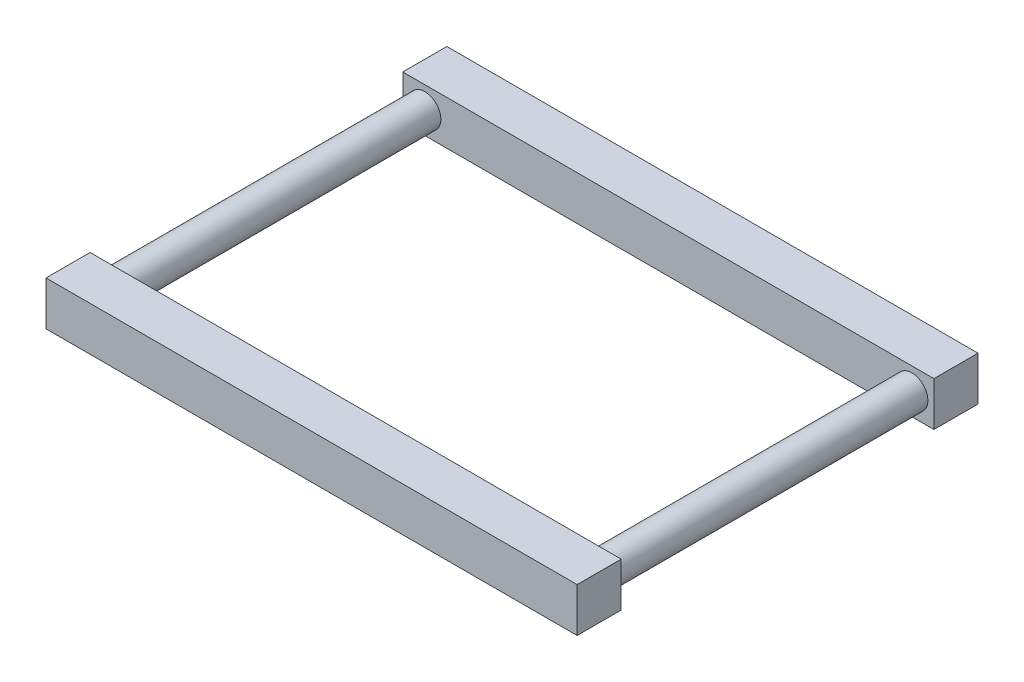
ISO-10303-21;
HEADER;
FILE_DESCRIPTION(('STEP AP214'),'2;1');
FILE_NAME('part.step','',(''),(''),'','','');
FILE_SCHEMA(('AUTOMOTIVE_DESIGN { 1 0 10303 214 1 1 1 1 }'));
ENDSEC;
DATA;
#1=APPLICATION_CONTEXT('core data for automotive mechanical design processes');
#2=APPLICATION_PROTOCOL_DEFINITION('international standard','automotive_design',2000,#1);
#3=PRODUCT_CONTEXT('',#1,'mechanical');
#4=PRODUCT('Part','Part','',(#3));
#5=PRODUCT_RELATED_PRODUCT_CATEGORY('part','',(#4));
#6=PRODUCT_DEFINITION_FORMATION('','',#4);
#7=PRODUCT_DEFINITION_CONTEXT('part definition',#1,'design');
#8=PRODUCT_DEFINITION('design','',#6,#7);
#9=PRODUCT_DEFINITION_SHAPE('','',#8);
#10=(LENGTH_UNIT() NAMED_UNIT(*) SI_UNIT(.MILLI.,.METRE.));
#11=(NAMED_UNIT(*) PLANE_ANGLE_UNIT() SI_UNIT($,.RADIAN.));
#12=(NAMED_UNIT(*) SI_UNIT($,.STERADIAN.) SOLID_ANGLE_UNIT());
#13=UNCERTAINTY_MEASURE_WITH_UNIT(LENGTH_MEASURE(1.E-05),#10,'distance_accuracy_value','');
#14=(GEOMETRIC_REPRESENTATION_CONTEXT(3) GLOBAL_UNCERTAINTY_ASSIGNED_CONTEXT((#13)) GLOBAL_UNIT_ASSIGNED_CONTEXT((#10,
#11,#12)) REPRESENTATION_CONTEXT('',''));
#15=CARTESIAN_POINT('',(0.,0.,0.));
#16=DIRECTION('',(0.,0.,1.));
#17=DIRECTION('',(1.,0.,0.));
#18=AXIS2_PLACEMENT_3D('',#15,#16,#17);
#19=CARTESIAN_POINT('',(0.,0.,0.));
#20=DIRECTION('',(0.,0.,-1.));
#21=DIRECTION('',(-1.,0.,0.));
#22=AXIS2_PLACEMENT_3D('',#19,#20,#21);
#23=CYLINDRICAL_SURFACE('',#22,20.32);
#24=CARTESIAN_POINT('',(0.,0.,198.12));
#25=DIRECTION('',(0.,0.,-1.));
#26=DIRECTION('',(-1.,0.,0.));
#27=AXIS2_PLACEMENT_3D('',#24,#25,#26);
#28=CIRCLE('',#27,20.3200000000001);
#29=CARTESIAN_POINT('',(-20.32,0.,198.12));
#30=VERTEX_POINT('',#29);
#31=EDGE_CURVE('E160',#30,#30,#28,.T.);
#32=ORIENTED_EDGE('',*,*,#31,.T.);
#33=EDGE_LOOP('',(#32));
#34=FACE_BOUND('',#33,.T.);
#35=CARTESIAN_POINT('',(0.,0.,-198.12));
#36=DIRECTION('',(0.,0.,-1.));
#37=DIRECTION('',(-1.,0.,0.));
#38=AXIS2_PLACEMENT_3D('',#35,#36,#37);
#39=CIRCLE('',#38,20.32);
#40=CARTESIAN_POINT('',(-20.32,0.,-198.12));
#41=VERTEX_POINT('',#40);
#42=EDGE_CURVE('E49',#41,#41,#39,.T.);
#43=ORIENTED_EDGE('',*,*,#42,.F.);
#44=EDGE_LOOP('',(#43));
#45=FACE_BOUND('',#44,.T.);
#46=ADVANCED_FACE('F41',(#34,#45),#23,.T.);
#47=CARTESIAN_POINT('',(0.,-27.94,-198.12));
#48=DIRECTION('',(0.,0.,1.));
#49=DIRECTION('',(1.,0.,0.));
#50=AXIS2_PLACEMENT_3D('',#47,#48,#49);
#51=PLANE('',#50);
#52=CARTESIAN_POINT('',(617.22,0.,-198.12));
#53=DIRECTION('',(0.,0.,-1.));
#54=DIRECTION('',(-1.,0.,0.));
#55=AXIS2_PLACEMENT_3D('',#52,#53,#54);
#56=CIRCLE('',#55,20.32);
#57=CARTESIAN_POINT('',(596.9,0.,-198.12));
#58=VERTEX_POINT('',#57);
#59=EDGE_CURVE('E136',#58,#58,#56,.T.);
#60=ORIENTED_EDGE('',*,*,#59,.T.);
#61=EDGE_LOOP('',(#60));
#62=FACE_BOUND('',#61,.T.);
#63=ORIENTED_EDGE('',*,*,#42,.T.);
#64=EDGE_LOOP('',(#63));
#65=FACE_BOUND('',#64,.T.);
#66=DIRECTION('',(0.,1.,0.));
#67=VECTOR('',#66,1.);
#68=CARTESIAN_POINT('',(645.16,-27.94,-198.12));
#69=LINE('',#68,#67);
#70=CARTESIAN_POINT('',(645.16,-27.94,-198.12));
#71=VERTEX_POINT('',#70);
#72=CARTESIAN_POINT('',(645.16,27.94,-198.12));
#73=VERTEX_POINT('',#72);
#74=EDGE_CURVE('E194',#71,#73,#69,.T.);
#75=ORIENTED_EDGE('',*,*,#74,.T.);
#76=DIRECTION('',(1.,0.,0.));
#77=VECTOR('',#76,1.);
#78=CARTESIAN_POINT('',(0.,27.94,-198.12));
#79=LINE('',#78,#77);
#80=CARTESIAN_POINT('',(-27.94,27.94,-198.12));
#81=VERTEX_POINT('',#80);
#82=EDGE_CURVE('E166',#81,#73,#79,.T.);
#83=ORIENTED_EDGE('',*,*,#82,.F.);
#84=DIRECTION('',(0.,1.,0.));
#85=VECTOR('',#84,1.);
#86=CARTESIAN_POINT('',(-27.94,-27.94,-198.12));
#87=LINE('',#86,#85);
#88=CARTESIAN_POINT('',(-27.94,-27.94,-198.12));
#89=VERTEX_POINT('',#88);
#90=EDGE_CURVE('E56',#89,#81,#87,.T.);
#91=ORIENTED_EDGE('',*,*,#90,.F.);
#92=DIRECTION('',(1.,0.,0.));
#93=VECTOR('',#92,1.);
#94=CARTESIAN_POINT('',(0.,-27.94,-198.12));
#95=LINE('',#94,#93);
#96=EDGE_CURVE('E182',#89,#71,#95,.T.);
#97=ORIENTED_EDGE('',*,*,#96,.T.);
#98=EDGE_LOOP('',(#75,#83,#91,#97));
#99=FACE_BOUND('',#98,.T.);
#100=ADVANCED_FACE('F231',(#62,#65,#99),#51,.T.);
#101=CARTESIAN_POINT('',(-27.94,-27.94,0.));
#102=DIRECTION('',(1.,0.,0.));
#103=DIRECTION('',(0.,0.,-1.));
#104=AXIS2_PLACEMENT_3D('',#101,#102,#103);
#105=PLANE('',#104);
#106=ORIENTED_EDGE('',*,*,#90,.T.);
#107=DIRECTION('',(0.,0.,-1.));
#108=VECTOR('',#107,1.);
#109=CARTESIAN_POINT('',(-27.94,27.94,0.));
#110=LINE('',#109,#108);
#111=CARTESIAN_POINT('',(-27.94,27.94,-254.));
#112=VERTEX_POINT('',#111);
#113=EDGE_CURVE('E178',#81,#112,#110,.T.);
#114=ORIENTED_EDGE('',*,*,#113,.T.);
#115=DIRECTION('',(0.,1.,0.));
#116=VECTOR('',#115,1.);
#117=CARTESIAN_POINT('',(-27.94,-27.94,-254.));
#118=LINE('',#117,#116);
#119=CARTESIAN_POINT('',(-27.94,-27.94,-254.));
#120=VERTEX_POINT('',#119);
#121=EDGE_CURVE('E197',#120,#112,#118,.T.);
#122=ORIENTED_EDGE('',*,*,#121,.F.);
#123=DIRECTION('',(0.,0.,-1.));
#124=VECTOR('',#123,1.);
#125=CARTESIAN_POINT('',(-27.94,-27.94,0.));
#126=LINE('',#125,#124);
#127=EDGE_CURVE('E63',#89,#120,#126,.T.);
#128=ORIENTED_EDGE('',*,*,#127,.F.);
#129=EDGE_LOOP('',(#106,#114,#122,#128));
#130=FACE_BOUND('',#129,.T.);
#131=ADVANCED_FACE('F235',(#130),#105,.F.);
#132=CARTESIAN_POINT('',(0.,-27.94,-254.));
#133=DIRECTION('',(0.,0.,1.));
#134=DIRECTION('',(1.,0.,0.));
#135=AXIS2_PLACEMENT_3D('',#132,#133,#134);
#136=PLANE('',#135);
#137=ORIENTED_EDGE('',*,*,#121,.T.);
#138=DIRECTION('',(1.,0.,0.));
#139=VECTOR('',#138,1.);
#140=CARTESIAN_POINT('',(0.,27.94,-254.));
#141=LINE('',#140,#139);
#142=CARTESIAN_POINT('',(645.16,27.94,-254.));
#143=VERTEX_POINT('',#142);
#144=EDGE_CURVE('E174',#112,#143,#141,.T.);
#145=ORIENTED_EDGE('',*,*,#144,.T.);
#146=DIRECTION('',(0.,1.,0.));
#147=VECTOR('',#146,1.);
#148=CARTESIAN_POINT('',(645.16,-27.94,-254.));
#149=LINE('',#148,#147);
#150=CARTESIAN_POINT('',(645.16,-27.94,-254.));
#151=VERTEX_POINT('',#150);
#152=EDGE_CURVE('E200',#151,#143,#149,.T.);
#153=ORIENTED_EDGE('',*,*,#152,.F.);
#154=DIRECTION('',(1.,0.,0.));
#155=VECTOR('',#154,1.);
#156=CARTESIAN_POINT('',(0.,-27.94,-254.));
#157=LINE('',#156,#155);
#158=EDGE_CURVE('E189',#120,#151,#157,.T.);
#159=ORIENTED_EDGE('',*,*,#158,.F.);
#160=EDGE_LOOP('',(#137,#145,#153,#159));
#161=FACE_BOUND('',#160,.T.);
#162=ADVANCED_FACE('F240',(#161),#136,.F.);
#163=CARTESIAN_POINT('',(645.16,-27.94,0.));
#164=DIRECTION('',(1.,0.,0.));
#165=DIRECTION('',(0.,0.,-1.));
#166=AXIS2_PLACEMENT_3D('',#163,#164,#165);
#167=PLANE('',#166);
#168=ORIENTED_EDGE('',*,*,#152,.T.);
#169=DIRECTION('',(0.,0.,-1.));
#170=VECTOR('',#169,1.);
#171=CARTESIAN_POINT('',(645.16,27.94,0.));
#172=LINE('',#171,#170);
#173=EDGE_CURVE('E170',#73,#143,#172,.T.);
#174=ORIENTED_EDGE('',*,*,#173,.F.);
#175=ORIENTED_EDGE('',*,*,#74,.F.);
#176=DIRECTION('',(0.,0.,-1.));
#177=VECTOR('',#176,1.);
#178=CARTESIAN_POINT('',(645.16,-27.94,0.));
#179=LINE('',#178,#177);
#180=EDGE_CURVE('E185',#71,#151,#179,.T.);
#181=ORIENTED_EDGE('',*,*,#180,.T.);
#182=EDGE_LOOP('',(#168,#174,#175,#181));
#183=FACE_BOUND('',#182,.T.);
#184=ADVANCED_FACE('F245',(#183),#167,.T.);
#185=CARTESIAN_POINT('',(0.,-27.94,0.));
#186=DIRECTION('',(0.,1.,0.));
#187=DIRECTION('',(0.,0.,1.));
#188=AXIS2_PLACEMENT_3D('',#185,#186,#187);
#189=PLANE('',#188);
#190=ORIENTED_EDGE('',*,*,#96,.F.);
#191=ORIENTED_EDGE('',*,*,#127,.T.);
#192=ORIENTED_EDGE('',*,*,#158,.T.);
#193=ORIENTED_EDGE('',*,*,#180,.F.);
#194=EDGE_LOOP('',(#190,#191,#192,#193));
#195=FACE_BOUND('',#194,.T.);
#196=ADVANCED_FACE('F225',(#195),#189,.F.);
#197=CARTESIAN_POINT('',(0.,27.94,0.));
#198=DIRECTION('',(0.,1.,0.));
#199=DIRECTION('',(0.,0.,1.));
#200=AXIS2_PLACEMENT_3D('',#197,#198,#199);
#201=PLANE('',#200);
#202=ORIENTED_EDGE('',*,*,#82,.T.);
#203=ORIENTED_EDGE('',*,*,#173,.T.);
#204=ORIENTED_EDGE('',*,*,#144,.F.);
#205=ORIENTED_EDGE('',*,*,#113,.F.);
#206=EDGE_LOOP('',(#202,#203,#204,#205));
#207=FACE_BOUND('',#206,.T.);
#208=ADVANCED_FACE('F215',(#207),#201,.T.);
#209=CARTESIAN_POINT('',(0.,-27.94,198.12));
#210=DIRECTION('',(0.,0.,1.));
#211=DIRECTION('',(1.,0.,0.));
#212=AXIS2_PLACEMENT_3D('',#209,#210,#211);
#213=PLANE('',#212);
#214=CARTESIAN_POINT('',(617.22,0.,198.12));
#215=DIRECTION('',(0.,0.,1.));
#216=DIRECTION('',(1.,0.,0.));
#217=AXIS2_PLACEMENT_3D('',#214,#215,#216);
#218=CIRCLE('',#217,20.32);
#219=CARTESIAN_POINT('',(637.54,0.,198.12));
#220=VERTEX_POINT('',#219);
#221=EDGE_CURVE('E11',#220,#220,#218,.F.);
#222=ORIENTED_EDGE('',*,*,#221,.F.);
#223=EDGE_LOOP('',(#222));
#224=FACE_BOUND('',#223,.T.);
#225=ORIENTED_EDGE('',*,*,#31,.F.);
#226=EDGE_LOOP('',(#225));
#227=FACE_BOUND('',#226,.T.);
#228=DIRECTION('',(0.,1.,0.));
#229=VECTOR('',#228,1.);
#230=CARTESIAN_POINT('',(-27.94,-27.94,198.12));
#231=LINE('',#230,#229);
#232=CARTESIAN_POINT('',(-27.94,-27.94,198.12));
#233=VERTEX_POINT('',#232);
#234=CARTESIAN_POINT('',(-27.94,27.94,198.12));
#235=VERTEX_POINT('',#234);
#236=EDGE_CURVE('E107',#233,#235,#231,.T.);
#237=ORIENTED_EDGE('',*,*,#236,.T.);
#238=DIRECTION('',(1.,0.,0.));
#239=VECTOR('',#238,1.);
#240=CARTESIAN_POINT('',(0.,27.94,198.12));
#241=LINE('',#240,#239);
#242=CARTESIAN_POINT('',(645.16,27.94,198.12));
#243=VERTEX_POINT('',#242);
#244=EDGE_CURVE('E112',#235,#243,#241,.T.);
#245=ORIENTED_EDGE('',*,*,#244,.T.);
#246=DIRECTION('',(0.,1.,0.));
#247=VECTOR('',#246,1.);
#248=CARTESIAN_POINT('',(645.16,-27.94,198.12));
#249=LINE('',#248,#247);
#250=CARTESIAN_POINT('',(645.16,-27.94,198.12));
#251=VERTEX_POINT('',#250);
#252=EDGE_CURVE('E157',#251,#243,#249,.T.);
#253=ORIENTED_EDGE('',*,*,#252,.F.);
#254=DIRECTION('',(1.,0.,0.));
#255=VECTOR('',#254,1.);
#256=CARTESIAN_POINT('',(0.,-27.94,198.12));
#257=LINE('',#256,#255);
#258=EDGE_CURVE('E115',#233,#251,#257,.T.);
#259=ORIENTED_EDGE('',*,*,#258,.F.);
#260=EDGE_LOOP('',(#237,#245,#253,#259));
#261=FACE_BOUND('',#260,.T.);
#262=ADVANCED_FACE('F109',(#224,#227,#261),#213,.F.);
#263=CARTESIAN_POINT('',(645.16,-27.94,0.));
#264=DIRECTION('',(-1.,0.,0.));
#265=DIRECTION('',(0.,0.,1.));
#266=AXIS2_PLACEMENT_3D('',#263,#264,#265);
#267=PLANE('',#266);
#268=ORIENTED_EDGE('',*,*,#252,.T.);
#269=DIRECTION('',(0.,0.,1.));
#270=VECTOR('',#269,1.);
#271=CARTESIAN_POINT('',(645.16,27.94,0.));
#272=LINE('',#271,#270);
#273=CARTESIAN_POINT('',(645.16,27.94,254.));
#274=VERTEX_POINT('',#273);
#275=EDGE_CURVE('E134',#243,#274,#272,.T.);
#276=ORIENTED_EDGE('',*,*,#275,.T.);
#277=DIRECTION('',(0.,1.,0.));
#278=VECTOR('',#277,1.);
#279=CARTESIAN_POINT('',(645.16,-27.94,254.));
#280=LINE('',#279,#278);
#281=CARTESIAN_POINT('',(645.16,-27.94,254.));
#282=VERTEX_POINT('',#281);
#283=EDGE_CURVE('E161',#282,#274,#280,.T.);
#284=ORIENTED_EDGE('',*,*,#283,.F.);
#285=DIRECTION('',(0.,0.,1.));
#286=VECTOR('',#285,1.);
#287=CARTESIAN_POINT('',(645.16,-27.94,0.));
#288=LINE('',#287,#286);
#289=EDGE_CURVE('E121',#251,#282,#288,.T.);
#290=ORIENTED_EDGE('',*,*,#289,.F.);
#291=EDGE_LOOP('',(#268,#276,#284,#290));
#292=FACE_BOUND('',#291,.T.);
#293=ADVANCED_FACE('F214',(#292),#267,.F.);
#294=CARTESIAN_POINT('',(0.,-27.94,254.));
#295=DIRECTION('',(0.,0.,1.));
#296=DIRECTION('',(1.,0.,0.));
#297=AXIS2_PLACEMENT_3D('',#294,#295,#296);
#298=PLANE('',#297);
#299=ORIENTED_EDGE('',*,*,#283,.T.);
#300=DIRECTION('',(1.,0.,0.));
#301=VECTOR('',#300,1.);
#302=CARTESIAN_POINT('',(0.,27.94,254.));
#303=LINE('',#302,#301);
#304=CARTESIAN_POINT('',(-27.94,27.94,254.));
#305=VERTEX_POINT('',#304);
#306=EDGE_CURVE('E130',#305,#274,#303,.T.);
#307=ORIENTED_EDGE('',*,*,#306,.F.);
#308=DIRECTION('',(0.,1.,0.));
#309=VECTOR('',#308,1.);
#310=CARTESIAN_POINT('',(-27.94,-27.94,254.));
#311=LINE('',#310,#309);
#312=CARTESIAN_POINT('',(-27.94,-27.94,254.));
#313=VERTEX_POINT('',#312);
#314=EDGE_CURVE('E120',#313,#305,#311,.T.);
#315=ORIENTED_EDGE('',*,*,#314,.F.);
#316=DIRECTION('',(1.,0.,0.));
#317=VECTOR('',#316,1.);
#318=CARTESIAN_POINT('',(0.,-27.94,254.));
#319=LINE('',#318,#317);
#320=EDGE_CURVE('E151',#313,#282,#319,.T.);
#321=ORIENTED_EDGE('',*,*,#320,.T.);
#322=EDGE_LOOP('',(#299,#307,#315,#321));
#323=FACE_BOUND('',#322,.T.);
#324=ADVANCED_FACE('F222',(#323),#298,.T.);
#325=CARTESIAN_POINT('',(-27.94,-27.94,0.));
#326=DIRECTION('',(-1.,0.,0.));
#327=DIRECTION('',(0.,0.,1.));
#328=AXIS2_PLACEMENT_3D('',#325,#326,#327);
#329=PLANE('',#328);
#330=ORIENTED_EDGE('',*,*,#314,.T.);
#331=DIRECTION('',(0.,0.,1.));
#332=VECTOR('',#331,1.);
#333=CARTESIAN_POINT('',(-27.94,27.94,0.));
#334=LINE('',#333,#332);
#335=EDGE_CURVE('E124',#235,#305,#334,.T.);
#336=ORIENTED_EDGE('',*,*,#335,.F.);
#337=ORIENTED_EDGE('',*,*,#236,.F.);
#338=DIRECTION('',(0.,0.,1.));
#339=VECTOR('',#338,1.);
#340=CARTESIAN_POINT('',(-27.94,-27.94,0.));
#341=LINE('',#340,#339);
#342=EDGE_CURVE('E148',#233,#313,#341,.T.);
#343=ORIENTED_EDGE('',*,*,#342,.T.);
#344=EDGE_LOOP('',(#330,#336,#337,#343));
#345=FACE_BOUND('',#344,.T.);
#346=ADVANCED_FACE('F125',(#345),#329,.T.);
#347=CARTESIAN_POINT('',(0.,-27.94,0.));
#348=DIRECTION('',(0.,1.,0.));
#349=DIRECTION('',(0.,0.,1.));
#350=AXIS2_PLACEMENT_3D('',#347,#348,#349);
#351=PLANE('',#350);
#352=ORIENTED_EDGE('',*,*,#258,.T.);
#353=ORIENTED_EDGE('',*,*,#289,.T.);
#354=ORIENTED_EDGE('',*,*,#320,.F.);
#355=ORIENTED_EDGE('',*,*,#342,.F.);
#356=EDGE_LOOP('',(#352,#353,#354,#355));
#357=FACE_BOUND('',#356,.T.);
#358=ADVANCED_FACE('F295',(#357),#351,.F.);
#359=CARTESIAN_POINT('',(0.,27.94,0.));
#360=DIRECTION('',(0.,1.,0.));
#361=DIRECTION('',(0.,0.,1.));
#362=AXIS2_PLACEMENT_3D('',#359,#360,#361);
#363=PLANE('',#362);
#364=ORIENTED_EDGE('',*,*,#244,.F.);
#365=ORIENTED_EDGE('',*,*,#335,.T.);
#366=ORIENTED_EDGE('',*,*,#306,.T.);
#367=ORIENTED_EDGE('',*,*,#275,.F.);
#368=EDGE_LOOP('',(#364,#365,#366,#367));
#369=FACE_BOUND('',#368,.T.);
#370=ADVANCED_FACE('F132',(#369),#363,.T.);
#371=CARTESIAN_POINT('',(617.22,0.,0.));
#372=DIRECTION('',(0.,0.,-1.));
#373=DIRECTION('',(-1.,0.,0.));
#374=AXIS2_PLACEMENT_3D('',#371,#372,#373);
#375=CYLINDRICAL_SURFACE('',#374,20.32);
#376=ORIENTED_EDGE('',*,*,#59,.F.);
#377=EDGE_LOOP('',(#376));
#378=FACE_BOUND('',#377,.T.);
#379=ORIENTED_EDGE('',*,*,#221,.T.);
#380=EDGE_LOOP('',(#379));
#381=FACE_BOUND('',#380,.T.);
#382=ADVANCED_FACE('F313',(#378,#381),#375,.T.);
#383=CLOSED_SHELL('',(#46,#100,#131,#162,#184,#196,#208,#262,#293,#324,#346,#358,#370,#382));
#384=MANIFOLD_SOLID_BREP('B2',#383);
#385=ADVANCED_BREP_SHAPE_REPRESENTATION('',(#18,#384),#14);
#386=SHAPE_DEFINITION_REPRESENTATION(#9,#385);
ENDSEC;
END-ISO-10303-21;
